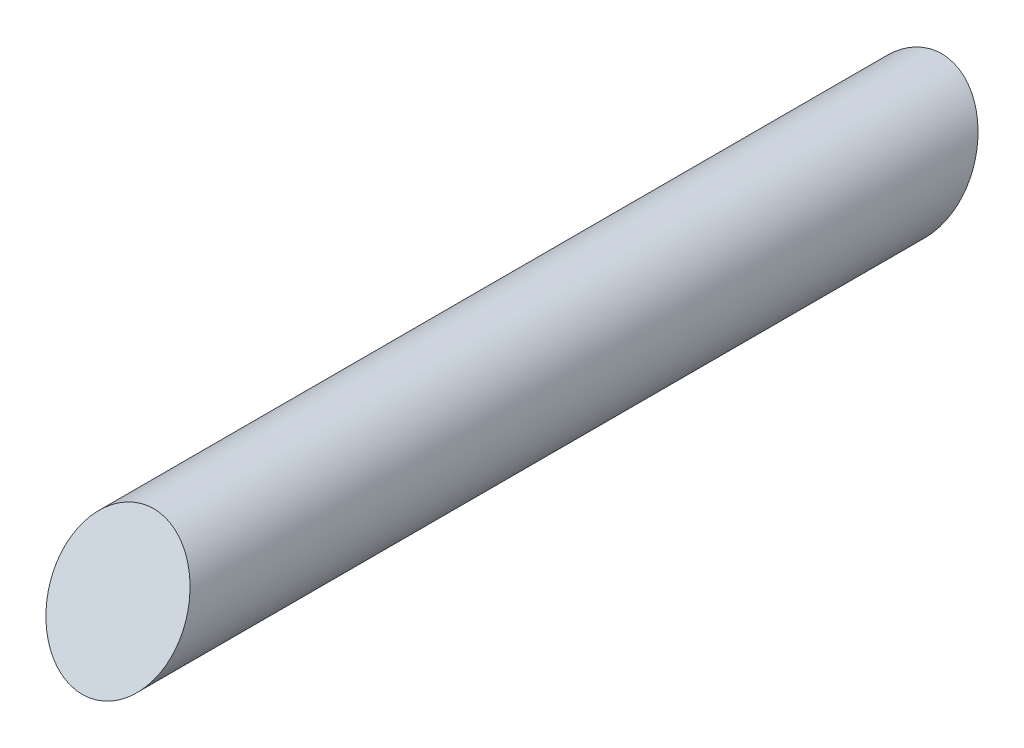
ISO-10303-21;
HEADER;
FILE_DESCRIPTION(('STEP AP214'),'2;1');
FILE_NAME('part.step','',(''),(''),'','','');
FILE_SCHEMA(('AUTOMOTIVE_DESIGN { 1 0 10303 214 1 1 1 1 }'));
ENDSEC;
DATA;
#1=APPLICATION_CONTEXT('core data for automotive mechanical design processes');
#2=APPLICATION_PROTOCOL_DEFINITION('international standard','automotive_design',2000,#1);
#3=PRODUCT_CONTEXT('',#1,'mechanical');
#4=PRODUCT('Part','Part','',(#3));
#5=PRODUCT_RELATED_PRODUCT_CATEGORY('part','',(#4));
#6=PRODUCT_DEFINITION_FORMATION('','',#4);
#7=PRODUCT_DEFINITION_CONTEXT('part definition',#1,'design');
#8=PRODUCT_DEFINITION('design','',#6,#7);
#9=PRODUCT_DEFINITION_SHAPE('','',#8);
#10=(LENGTH_UNIT() NAMED_UNIT(*) SI_UNIT(.MILLI.,.METRE.));
#11=(NAMED_UNIT(*) PLANE_ANGLE_UNIT() SI_UNIT($,.RADIAN.));
#12=(NAMED_UNIT(*) SI_UNIT($,.STERADIAN.) SOLID_ANGLE_UNIT());
#13=UNCERTAINTY_MEASURE_WITH_UNIT(LENGTH_MEASURE(1.E-05),#10,'distance_accuracy_value','');
#14=(GEOMETRIC_REPRESENTATION_CONTEXT(3) GLOBAL_UNCERTAINTY_ASSIGNED_CONTEXT((#13)) GLOBAL_UNIT_ASSIGNED_CONTEXT((#10,
#11,#12)) REPRESENTATION_CONTEXT('',''));
#15=CARTESIAN_POINT('',(0.,0.,0.));
#16=DIRECTION('',(0.,0.,1.));
#17=DIRECTION('',(1.,0.,0.));
#18=AXIS2_PLACEMENT_3D('',#15,#16,#17);
#19=CARTESIAN_POINT('',(0.,0.,527.558));
#20=DIRECTION('',(0.,0.,-1.));
#21=DIRECTION('',(-1.,0.,0.));
#22=AXIS2_PLACEMENT_3D('',#19,#20,#21);
#23=CYLINDRICAL_SURFACE('',#22,38.4080735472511);
#24=CARTESIAN_POINT('',(0.,0.,21.9318737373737));
#25=DIRECTION('',(0.,-0.495873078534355,-0.868395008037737));
#26=DIRECTION('',(0.,0.868395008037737,-0.495873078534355));
#27=AXIS2_PLACEMENT_3D('',#24,#25,#26);
#28=ELLIPSE('',#27,44.2288050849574,38.4080735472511);
#29=CARTESIAN_POINT('',(0.,38.4080735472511,0.));
#30=VERTEX_POINT('',#29);
#31=EDGE_CURVE('E35',#30,#30,#28,.T.);
#32=ORIENTED_EDGE('',*,*,#31,.F.);
#33=EDGE_LOOP('',(#32));
#34=FACE_BOUND('',#33,.T.);
#35=CARTESIAN_POINT('',(0.,0.,505.626126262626));
#36=DIRECTION('',(0.,0.495873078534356,0.868395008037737));
#37=DIRECTION('',(0.,0.868395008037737,-0.495873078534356));
#38=AXIS2_PLACEMENT_3D('',#35,#36,#37);
#39=ELLIPSE('',#38,44.2288050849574,38.4080735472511);
#40=CARTESIAN_POINT('',(0.,38.4080735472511,483.694252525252));
#41=VERTEX_POINT('',#40);
#42=EDGE_CURVE('E11',#41,#41,#39,.T.);
#43=ORIENTED_EDGE('',*,*,#42,.F.);
#44=EDGE_LOOP('',(#43));
#45=FACE_BOUND('',#44,.T.);
#46=ADVANCED_FACE('F29',(#34,#45),#23,.T.);
#47=CARTESIAN_POINT('',(-38.4080735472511,38.4080735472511,0.));
#48=DIRECTION('',(0.,-0.495873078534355,-0.868395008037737));
#49=DIRECTION('',(0.,0.868395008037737,-0.495873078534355));
#50=AXIS2_PLACEMENT_3D('',#47,#48,#49);
#51=PLANE('',#50);
#52=ORIENTED_EDGE('',*,*,#31,.T.);
#53=EDGE_LOOP('',(#52));
#54=FACE_BOUND('',#53,.T.);
#55=ADVANCED_FACE('F41',(#54),#51,.T.);
#56=CARTESIAN_POINT('',(-38.4080735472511,-38.4080735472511,527.558));
#57=DIRECTION('',(0.,0.495873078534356,0.868395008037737));
#58=DIRECTION('',(0.,-0.868395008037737,0.495873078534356));
#59=AXIS2_PLACEMENT_3D('',#56,#57,#58);
#60=PLANE('',#59);
#61=ORIENTED_EDGE('',*,*,#42,.T.);
#62=EDGE_LOOP('',(#61));
#63=FACE_BOUND('',#62,.T.);
#64=ADVANCED_FACE('F48',(#63),#60,.T.);
#65=CLOSED_SHELL('',(#46,#55,#64));
#66=MANIFOLD_SOLID_BREP('B2',#65);
#67=ADVANCED_BREP_SHAPE_REPRESENTATION('',(#18,#66),#14);
#68=SHAPE_DEFINITION_REPRESENTATION(#9,#67);
ENDSEC;
END-ISO-10303-21;
